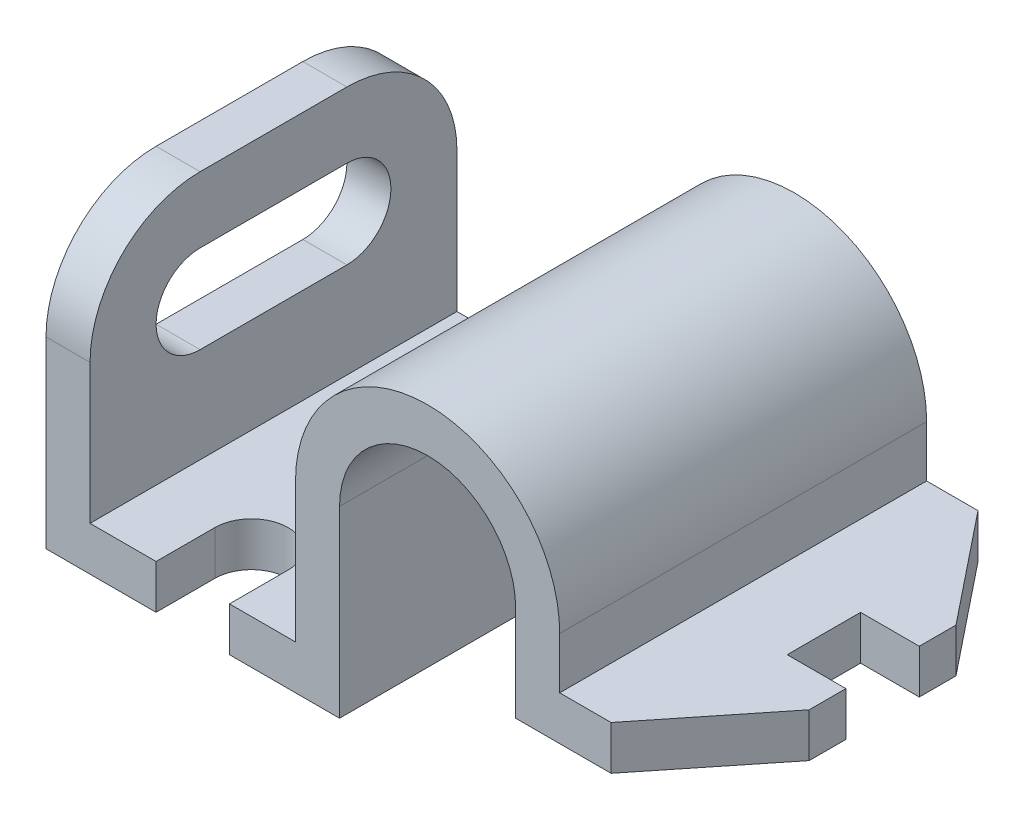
ISO-10303-21;
HEADER;
FILE_DESCRIPTION(('STEP AP214'),'2;1');
FILE_NAME('part.step','',(''),(''),'','','');
FILE_SCHEMA(('AUTOMOTIVE_DESIGN { 1 0 10303 214 1 1 1 1 }'));
ENDSEC;
DATA;
#1=APPLICATION_CONTEXT('core data for automotive mechanical design processes');
#2=APPLICATION_PROTOCOL_DEFINITION('international standard','automotive_design',2000,#1);
#3=PRODUCT_CONTEXT('',#1,'mechanical');
#4=PRODUCT('Part','Part','',(#3));
#5=PRODUCT_RELATED_PRODUCT_CATEGORY('part','',(#4));
#6=PRODUCT_DEFINITION_FORMATION('','',#4);
#7=PRODUCT_DEFINITION_CONTEXT('part definition',#1,'design');
#8=PRODUCT_DEFINITION('design','',#6,#7);
#9=PRODUCT_DEFINITION_SHAPE('','',#8);
#10=(LENGTH_UNIT() NAMED_UNIT(*) SI_UNIT(.MILLI.,.METRE.));
#11=(NAMED_UNIT(*) PLANE_ANGLE_UNIT() SI_UNIT($,.RADIAN.));
#12=(NAMED_UNIT(*) SI_UNIT($,.STERADIAN.) SOLID_ANGLE_UNIT());
#13=UNCERTAINTY_MEASURE_WITH_UNIT(LENGTH_MEASURE(1.E-05),#10,'distance_accuracy_value','');
#14=(GEOMETRIC_REPRESENTATION_CONTEXT(3) GLOBAL_UNCERTAINTY_ASSIGNED_CONTEXT((#13)) GLOBAL_UNIT_ASSIGNED_CONTEXT((#10,
#11,#12)) REPRESENTATION_CONTEXT('',''));
#15=CARTESIAN_POINT('',(0.,0.,0.));
#16=DIRECTION('',(0.,0.,1.));
#17=DIRECTION('',(1.,0.,0.));
#18=AXIS2_PLACEMENT_3D('',#15,#16,#17);
#19=CARTESIAN_POINT('',(64.,12.,25.));
#20=DIRECTION('',(0.,1.,0.));
#21=DIRECTION('',(0.,0.,1.));
#22=AXIS2_PLACEMENT_3D('',#19,#20,#21);
#23=PLANE('',#22);
#24=DIRECTION('',(0.624695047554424,0.,0.780868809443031));
#25=VECTOR('',#24,1.);
#26=CARTESIAN_POINT('',(89.,12.,-9.99999999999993));
#27=LINE('',#26,#25);
#28=CARTESIAN_POINT('',(89.,12.,-9.99999999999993));
#29=VERTEX_POINT('',#28);
#30=CARTESIAN_POINT('',(77.,12.,-25.));
#31=VERTEX_POINT('',#30);
#32=EDGE_CURVE('E63',#29,#31,#27,.F.);
#33=ORIENTED_EDGE('',*,*,#32,.F.);
#34=DIRECTION('',(0.,0.,-1.));
#35=VECTOR('',#34,1.);
#36=CARTESIAN_POINT('',(89.,12.,25.));
#37=LINE('',#36,#35);
#38=CARTESIAN_POINT('',(89.,12.,-5.));
#39=VERTEX_POINT('',#38);
#40=EDGE_CURVE('E356',#39,#29,#37,.T.);
#41=ORIENTED_EDGE('',*,*,#40,.F.);
#42=DIRECTION('',(-1.,0.,0.));
#43=VECTOR('',#42,1.);
#44=CARTESIAN_POINT('',(64.,12.,-5.));
#45=LINE('',#44,#43);
#46=CARTESIAN_POINT('',(81.,12.,-5.));
#47=VERTEX_POINT('',#46);
#48=EDGE_CURVE('E406',#39,#47,#45,.T.);
#49=ORIENTED_EDGE('',*,*,#48,.T.);
#50=DIRECTION('',(0.,0.,1.));
#51=VECTOR('',#50,1.);
#52=CARTESIAN_POINT('',(81.,12.,25.));
#53=LINE('',#52,#51);
#54=CARTESIAN_POINT('',(81.,12.,5.));
#55=VERTEX_POINT('',#54);
#56=EDGE_CURVE('E398',#47,#55,#53,.T.);
#57=ORIENTED_EDGE('',*,*,#56,.T.);
#58=DIRECTION('',(1.,0.,0.));
#59=VECTOR('',#58,1.);
#60=CARTESIAN_POINT('',(64.,12.,5.));
#61=LINE('',#60,#59);
#62=CARTESIAN_POINT('',(89.,12.,5.));
#63=VERTEX_POINT('',#62);
#64=EDGE_CURVE('E396',#55,#63,#61,.T.);
#65=ORIENTED_EDGE('',*,*,#64,.T.);
#66=CARTESIAN_POINT('',(89.,12.,9.99999999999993));
#67=VERTEX_POINT('',#66);
#68=EDGE_CURVE('E357',#67,#63,#37,.T.);
#69=ORIENTED_EDGE('',*,*,#68,.F.);
#70=DIRECTION('',(0.624695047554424,0.,-0.780868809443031));
#71=VECTOR('',#70,1.);
#72=CARTESIAN_POINT('',(89.,12.,9.99999999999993));
#73=LINE('',#72,#71);
#74=CARTESIAN_POINT('',(77.,12.,25.));
#75=VERTEX_POINT('',#74);
#76=EDGE_CURVE('E371',#67,#75,#73,.F.);
#77=ORIENTED_EDGE('',*,*,#76,.T.);
#78=DIRECTION('',(1.,0.,0.));
#79=VECTOR('',#78,1.);
#80=CARTESIAN_POINT('',(64.,12.,25.));
#81=LINE('',#80,#79);
#82=CARTESIAN_POINT('',(64.,12.,25.));
#83=VERTEX_POINT('',#82);
#84=EDGE_CURVE('E319',#83,#75,#81,.T.);
#85=ORIENTED_EDGE('',*,*,#84,.F.);
#86=DIRECTION('',(0.,0.,-1.));
#87=VECTOR('',#86,1.);
#88=CARTESIAN_POINT('',(64.,12.,25.));
#89=LINE('',#88,#87);
#90=CARTESIAN_POINT('',(64.,12.,-25.));
#91=VERTEX_POINT('',#90);
#92=EDGE_CURVE('E320',#83,#91,#89,.T.);
#93=ORIENTED_EDGE('',*,*,#92,.T.);
#94=DIRECTION('',(1.,0.,0.));
#95=VECTOR('',#94,1.);
#96=CARTESIAN_POINT('',(64.,12.,-25.));
#97=LINE('',#96,#95);
#98=EDGE_CURVE('E289',#91,#31,#97,.T.);
#99=ORIENTED_EDGE('',*,*,#98,.T.);
#100=EDGE_LOOP('',(#33,#41,#49,#57,#65,#69,#77,#85,#93,#99));
#101=FACE_BOUND('',#100,.T.);
#102=ADVANCED_FACE('F48',(#101),#23,.F.);
#103=CARTESIAN_POINT('',(89.,18.,25.));
#104=DIRECTION('',(1.,0.,0.));
#105=DIRECTION('',(0.,0.,-1.));
#106=AXIS2_PLACEMENT_3D('',#103,#104,#105);
#107=PLANE('',#106);
#108=ORIENTED_EDGE('',*,*,#40,.T.);
#109=DIRECTION('',(0.,-1.,0.));
#110=VECTOR('',#109,1.);
#111=CARTESIAN_POINT('',(89.,18.,-9.99999999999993));
#112=LINE('',#111,#110);
#113=CARTESIAN_POINT('',(89.,18.,-9.99999999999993));
#114=VERTEX_POINT('',#113);
#115=EDGE_CURVE('E598',#114,#29,#112,.T.);
#116=ORIENTED_EDGE('',*,*,#115,.F.);
#117=DIRECTION('',(0.,0.,-1.));
#118=VECTOR('',#117,1.);
#119=CARTESIAN_POINT('',(89.,18.,25.));
#120=LINE('',#119,#118);
#121=CARTESIAN_POINT('',(89.,18.,-5.));
#122=VERTEX_POINT('',#121);
#123=EDGE_CURVE('E283',#122,#114,#120,.T.);
#124=ORIENTED_EDGE('',*,*,#123,.F.);
#125=DIRECTION('',(0.,1.,0.));
#126=VECTOR('',#125,1.);
#127=CARTESIAN_POINT('',(89.,0.,-5.));
#128=LINE('',#127,#126);
#129=EDGE_CURVE('E583',#39,#122,#128,.T.);
#130=ORIENTED_EDGE('',*,*,#129,.F.);
#131=EDGE_LOOP('',(#108,#116,#124,#130));
#132=FACE_BOUND('',#131,.T.);
#133=ADVANCED_FACE('F597',(#132),#107,.T.);
#134=CARTESIAN_POINT('',(64.,18.,25.));
#135=DIRECTION('',(0.,1.,0.));
#136=DIRECTION('',(0.,0.,1.));
#137=AXIS2_PLACEMENT_3D('',#134,#135,#136);
#138=PLANE('',#137);
#139=ORIENTED_EDGE('',*,*,#123,.T.);
#140=DIRECTION('',(-0.624695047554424,0.,-0.780868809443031));
#141=VECTOR('',#140,1.);
#142=CARTESIAN_POINT('',(71.9268292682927,18.,-31.3414634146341));
#143=LINE('',#142,#141);
#144=CARTESIAN_POINT('',(77.,18.,-25.));
#145=VERTEX_POINT('',#144);
#146=EDGE_CURVE('E268',#145,#114,#143,.F.);
#147=ORIENTED_EDGE('',*,*,#146,.F.);
#148=DIRECTION('',(1.,0.,0.));
#149=VECTOR('',#148,1.);
#150=CARTESIAN_POINT('',(64.,18.,-25.));
#151=LINE('',#150,#149);
#152=CARTESIAN_POINT('',(70.,18.,-25.));
#153=VERTEX_POINT('',#152);
#154=EDGE_CURVE('E279',#153,#145,#151,.T.);
#155=ORIENTED_EDGE('',*,*,#154,.F.);
#156=DIRECTION('',(0.,0.,-1.));
#157=VECTOR('',#156,1.);
#158=CARTESIAN_POINT('',(70.,18.,25.));
#159=LINE('',#158,#157);
#160=CARTESIAN_POINT('',(70.,18.,25.));
#161=VERTEX_POINT('',#160);
#162=EDGE_CURVE('E352',#161,#153,#159,.T.);
#163=ORIENTED_EDGE('',*,*,#162,.F.);
#164=DIRECTION('',(1.,0.,0.));
#165=VECTOR('',#164,1.);
#166=CARTESIAN_POINT('',(64.,18.,25.));
#167=LINE('',#166,#165);
#168=CARTESIAN_POINT('',(77.,18.,25.));
#169=VERTEX_POINT('',#168);
#170=EDGE_CURVE('E379',#161,#169,#167,.T.);
#171=ORIENTED_EDGE('',*,*,#170,.T.);
#172=DIRECTION('',(-0.624695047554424,0.,0.780868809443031));
#173=VECTOR('',#172,1.);
#174=CARTESIAN_POINT('',(71.9268292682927,18.,31.3414634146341));
#175=LINE('',#174,#173);
#176=CARTESIAN_POINT('',(89.,18.,9.99999999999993));
#177=VERTEX_POINT('',#176);
#178=EDGE_CURVE('E13',#169,#177,#175,.F.);
#179=ORIENTED_EDGE('',*,*,#178,.T.);
#180=CARTESIAN_POINT('',(89.,18.,5.));
#181=VERTEX_POINT('',#180);
#182=EDGE_CURVE('E354',#177,#181,#120,.T.);
#183=ORIENTED_EDGE('',*,*,#182,.T.);
#184=DIRECTION('',(1.,0.,0.));
#185=VECTOR('',#184,1.);
#186=CARTESIAN_POINT('',(89.,18.,5.));
#187=LINE('',#186,#185);
#188=CARTESIAN_POINT('',(81.,18.,5.));
#189=VERTEX_POINT('',#188);
#190=EDGE_CURVE('E580',#189,#181,#187,.T.);
#191=ORIENTED_EDGE('',*,*,#190,.F.);
#192=DIRECTION('',(0.,0.,1.));
#193=VECTOR('',#192,1.);
#194=CARTESIAN_POINT('',(81.,18.,5.));
#195=LINE('',#194,#193);
#196=CARTESIAN_POINT('',(81.,18.,-5.));
#197=VERTEX_POINT('',#196);
#198=EDGE_CURVE('E577',#197,#189,#195,.T.);
#199=ORIENTED_EDGE('',*,*,#198,.F.);
#200=DIRECTION('',(-1.,0.,0.));
#201=VECTOR('',#200,1.);
#202=CARTESIAN_POINT('',(89.,18.,-5.));
#203=LINE('',#202,#201);
#204=EDGE_CURVE('E569',#122,#197,#203,.T.);
#205=ORIENTED_EDGE('',*,*,#204,.F.);
#206=EDGE_LOOP('',(#139,#147,#155,#163,#171,#179,#183,#191,#199,#205));
#207=FACE_BOUND('',#206,.T.);
#208=ADVANCED_FACE('F278',(#207),#138,.T.);
#209=CARTESIAN_POINT('',(52.,25.,-25.));
#210=DIRECTION('',(0.,0.,1.));
#211=DIRECTION('',(1.,0.,0.));
#212=AXIS2_PLACEMENT_3D('',#209,#210,#211);
#213=PLANE('',#212);
#214=DIRECTION('',(0.,1.,0.));
#215=VECTOR('',#214,1.);
#216=CARTESIAN_POINT('',(77.,25.,-25.));
#217=LINE('',#216,#215);
#218=EDGE_CURVE('E265',#31,#145,#217,.T.);
#219=ORIENTED_EDGE('',*,*,#218,.F.);
#220=ORIENTED_EDGE('',*,*,#98,.F.);
#221=DIRECTION('',(0.,-1.,0.));
#222=VECTOR('',#221,1.);
#223=CARTESIAN_POINT('',(64.,25.,-25.));
#224=LINE('',#223,#222);
#225=CARTESIAN_POINT('',(64.,25.,-25.));
#226=VERTEX_POINT('',#225);
#227=EDGE_CURVE('E317',#226,#91,#224,.T.);
#228=ORIENTED_EDGE('',*,*,#227,.F.);
#229=CARTESIAN_POINT('',(52.,25.,-25.));
#230=DIRECTION('',(0.,0.,-1.));
#231=DIRECTION('',(-1.,0.,0.));
#232=AXIS2_PLACEMENT_3D('',#229,#230,#231);
#233=CIRCLE('',#232,12.);
#234=CARTESIAN_POINT('',(40.,25.,-25.));
#235=VERTEX_POINT('',#234);
#236=EDGE_CURVE('E315',#235,#226,#233,.T.);
#237=ORIENTED_EDGE('',*,*,#236,.F.);
#238=DIRECTION('',(0.,1.,0.));
#239=VECTOR('',#238,1.);
#240=CARTESIAN_POINT('',(40.,0.,-25.));
#241=LINE('',#240,#239);
#242=CARTESIAN_POINT('',(40.,0.,-25.));
#243=VERTEX_POINT('',#242);
#244=EDGE_CURVE('E313',#243,#235,#241,.T.);
#245=ORIENTED_EDGE('',*,*,#244,.F.);
#246=DIRECTION('',(1.,0.,0.));
#247=VECTOR('',#246,1.);
#248=CARTESIAN_POINT('',(0.,0.,-25.));
#249=LINE('',#248,#247);
#250=CARTESIAN_POINT('',(25.,0.,-25.));
#251=VERTEX_POINT('',#250);
#252=EDGE_CURVE('E309',#251,#243,#249,.T.);
#253=ORIENTED_EDGE('',*,*,#252,.F.);
#254=DIRECTION('',(0.,1.,0.));
#255=VECTOR('',#254,1.);
#256=CARTESIAN_POINT('',(25.,0.,-25.));
#257=LINE('',#256,#255);
#258=CARTESIAN_POINT('',(25.,6.,-25.));
#259=VERTEX_POINT('',#258);
#260=EDGE_CURVE('E511',#251,#259,#257,.T.);
#261=ORIENTED_EDGE('',*,*,#260,.T.);
#262=DIRECTION('',(1.,0.,0.));
#263=VECTOR('',#262,1.);
#264=CARTESIAN_POINT('',(0.,6.,-25.));
#265=LINE('',#264,#263);
#266=CARTESIAN_POINT('',(34.,6.,-25.));
#267=VERTEX_POINT('',#266);
#268=EDGE_CURVE('E301',#259,#267,#265,.T.);
#269=ORIENTED_EDGE('',*,*,#268,.T.);
#270=DIRECTION('',(0.,1.,0.));
#271=VECTOR('',#270,1.);
#272=CARTESIAN_POINT('',(34.,0.,-25.));
#273=LINE('',#272,#271);
#274=CARTESIAN_POINT('',(34.,25.,-25.));
#275=VERTEX_POINT('',#274);
#276=EDGE_CURVE('E298',#267,#275,#273,.T.);
#277=ORIENTED_EDGE('',*,*,#276,.T.);
#278=CARTESIAN_POINT('',(52.,25.,-25.));
#279=DIRECTION('',(0.,0.,1.));
#280=DIRECTION('',(1.,0.,0.));
#281=AXIS2_PLACEMENT_3D('',#278,#279,#280);
#282=CIRCLE('',#281,18.);
#283=CARTESIAN_POINT('',(70.,25.,-25.));
#284=VERTEX_POINT('',#283);
#285=EDGE_CURVE('E291',#275,#284,#282,.F.);
#286=ORIENTED_EDGE('',*,*,#285,.T.);
#287=DIRECTION('',(0.,1.,0.));
#288=VECTOR('',#287,1.);
#289=CARTESIAN_POINT('',(70.,25.,-25.));
#290=LINE('',#289,#288);
#291=EDGE_CURVE('E288',#284,#153,#290,.F.);
#292=ORIENTED_EDGE('',*,*,#291,.T.);
#293=ORIENTED_EDGE('',*,*,#154,.T.);
#294=EDGE_LOOP('',(#219,#220,#228,#237,#245,#253,#261,#269,#277,#286,#292,#293));
#295=FACE_BOUND('',#294,.T.);
#296=ADVANCED_FACE('F285',(#295),#213,.F.);
#297=CARTESIAN_POINT('',(6.,40.,25.));
#298=DIRECTION('',(1.,0.,0.));
#299=DIRECTION('',(0.,1.,0.));
#300=AXIS2_PLACEMENT_3D('',#297,#298,#299);
#301=PLANE('',#300);
#302=CARTESIAN_POINT('',(6.00000000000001,25.,-10.));
#303=DIRECTION('',(1.,0.,0.));
#304=DIRECTION('',(0.,1.,0.));
#305=AXIS2_PLACEMENT_3D('',#302,#303,#304);
#306=CIRCLE('',#305,5.99999999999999);
#307=CARTESIAN_POINT('',(6.00000000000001,31.,-10.));
#308=VERTEX_POINT('',#307);
#309=CARTESIAN_POINT('',(6.00000000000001,19.,-10.));
#310=VERTEX_POINT('',#309);
#311=EDGE_CURVE('E427',#308,#310,#306,.F.);
#312=ORIENTED_EDGE('',*,*,#311,.T.);
#313=DIRECTION('',(0.,0.,1.));
#314=VECTOR('',#313,1.);
#315=CARTESIAN_POINT('',(6.00000000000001,19.,-10.));
#316=LINE('',#315,#314);
#317=CARTESIAN_POINT('',(6.,19.,10.));
#318=VERTEX_POINT('',#317);
#319=EDGE_CURVE('E433',#310,#318,#316,.T.);
#320=ORIENTED_EDGE('',*,*,#319,.T.);
#321=CARTESIAN_POINT('',(6.00000000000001,25.,10.));
#322=DIRECTION('',(1.,0.,0.));
#323=DIRECTION('',(0.,1.,0.));
#324=AXIS2_PLACEMENT_3D('',#321,#322,#323);
#325=CIRCLE('',#324,5.99999999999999);
#326=CARTESIAN_POINT('',(6.00000000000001,31.,10.));
#327=VERTEX_POINT('',#326);
#328=EDGE_CURVE('E455',#318,#327,#325,.F.);
#329=ORIENTED_EDGE('',*,*,#328,.T.);
#330=DIRECTION('',(0.,0.,-1.));
#331=VECTOR('',#330,1.);
#332=CARTESIAN_POINT('',(6.00000000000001,31.,-10.));
#333=LINE('',#332,#331);
#334=EDGE_CURVE('E451',#327,#308,#333,.T.);
#335=ORIENTED_EDGE('',*,*,#334,.T.);
#336=EDGE_LOOP('',(#312,#320,#329,#335));
#337=FACE_BOUND('',#336,.T.);
#338=DIRECTION('',(0.,-1.,0.));
#339=VECTOR('',#338,1.);
#340=CARTESIAN_POINT('',(6.,40.,-25.));
#341=LINE('',#340,#339);
#342=CARTESIAN_POINT('',(6.,25.,-25.));
#343=VERTEX_POINT('',#342);
#344=CARTESIAN_POINT('',(6.,6.,-25.));
#345=VERTEX_POINT('',#344);
#346=EDGE_CURVE('E305',#343,#345,#341,.T.);
#347=ORIENTED_EDGE('',*,*,#346,.F.);
#348=CARTESIAN_POINT('',(6.,25.,-10.));
#349=DIRECTION('',(-1.,0.,0.));
#350=DIRECTION('',(0.,1.,0.));
#351=AXIS2_PLACEMENT_3D('',#348,#349,#350);
#352=CIRCLE('',#351,15.);
#353=CARTESIAN_POINT('',(6.,40.,-10.));
#354=VERTEX_POINT('',#353);
#355=EDGE_CURVE('E605',#354,#343,#352,.T.);
#356=ORIENTED_EDGE('',*,*,#355,.F.);
#357=DIRECTION('',(0.,0.,-1.));
#358=VECTOR('',#357,1.);
#359=CARTESIAN_POINT('',(6.,40.,25.));
#360=LINE('',#359,#358);
#361=CARTESIAN_POINT('',(6.,40.,10.));
#362=VERTEX_POINT('',#361);
#363=EDGE_CURVE('E339',#362,#354,#360,.T.);
#364=ORIENTED_EDGE('',*,*,#363,.F.);
#365=CARTESIAN_POINT('',(6.,25.,10.));
#366=DIRECTION('',(1.,0.,0.));
#367=DIRECTION('',(0.,1.,0.));
#368=AXIS2_PLACEMENT_3D('',#365,#366,#367);
#369=CIRCLE('',#368,15.);
#370=CARTESIAN_POINT('',(6.,25.,25.));
#371=VERTEX_POINT('',#370);
#372=EDGE_CURVE('E362',#362,#371,#369,.T.);
#373=ORIENTED_EDGE('',*,*,#372,.T.);
#374=DIRECTION('',(0.,-1.,0.));
#375=VECTOR('',#374,1.);
#376=CARTESIAN_POINT('',(6.,40.,25.));
#377=LINE('',#376,#375);
#378=CARTESIAN_POINT('',(6.,6.,25.));
#379=VERTEX_POINT('',#378);
#380=EDGE_CURVE('E475',#371,#379,#377,.T.);
#381=ORIENTED_EDGE('',*,*,#380,.T.);
#382=DIRECTION('',(0.,0.,-1.));
#383=VECTOR('',#382,1.);
#384=CARTESIAN_POINT('',(6.,6.,25.));
#385=LINE('',#384,#383);
#386=EDGE_CURVE('E342',#379,#345,#385,.T.);
#387=ORIENTED_EDGE('',*,*,#386,.T.);
#388=EDGE_LOOP('',(#347,#356,#364,#373,#381,#387));
#389=FACE_BOUND('',#388,.T.);
#390=ADVANCED_FACE('F633',(#337,#389),#301,.T.);
#391=CARTESIAN_POINT('',(0.,40.,25.));
#392=DIRECTION('',(1.,0.,0.));
#393=DIRECTION('',(0.,1.,0.));
#394=AXIS2_PLACEMENT_3D('',#391,#392,#393);
#395=PLANE('',#394);
#396=DIRECTION('',(0.,0.,1.));
#397=VECTOR('',#396,1.);
#398=CARTESIAN_POINT('',(0.,19.,-10.));
#399=LINE('',#398,#397);
#400=CARTESIAN_POINT('',(0.,19.,-10.));
#401=VERTEX_POINT('',#400);
#402=CARTESIAN_POINT('',(0.,19.,10.));
#403=VERTEX_POINT('',#402);
#404=EDGE_CURVE('E443',#401,#403,#399,.T.);
#405=ORIENTED_EDGE('',*,*,#404,.F.);
#406=CARTESIAN_POINT('',(0.,25.,-10.));
#407=DIRECTION('',(-1.,0.,0.));
#408=DIRECTION('',(0.,-1.,0.));
#409=AXIS2_PLACEMENT_3D('',#406,#407,#408);
#410=CIRCLE('',#409,5.99999999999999);
#411=CARTESIAN_POINT('',(0.,31.,-10.));
#412=VERTEX_POINT('',#411);
#413=EDGE_CURVE('E446',#412,#401,#410,.T.);
#414=ORIENTED_EDGE('',*,*,#413,.F.);
#415=DIRECTION('',(0.,0.,-1.));
#416=VECTOR('',#415,1.);
#417=CARTESIAN_POINT('',(0.,31.,-10.));
#418=LINE('',#417,#416);
#419=CARTESIAN_POINT('',(0.,31.,10.));
#420=VERTEX_POINT('',#419);
#421=EDGE_CURVE('E293',#420,#412,#418,.T.);
#422=ORIENTED_EDGE('',*,*,#421,.F.);
#423=CARTESIAN_POINT('',(0.,25.,10.));
#424=DIRECTION('',(-1.,0.,0.));
#425=DIRECTION('',(0.,-1.,0.));
#426=AXIS2_PLACEMENT_3D('',#423,#424,#425);
#427=CIRCLE('',#426,5.99999999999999);
#428=EDGE_CURVE('E440',#403,#420,#427,.T.);
#429=ORIENTED_EDGE('',*,*,#428,.F.);
#430=EDGE_LOOP('',(#405,#414,#422,#429));
#431=FACE_BOUND('',#430,.T.);
#432=CARTESIAN_POINT('',(0.,25.,-10.));
#433=DIRECTION('',(-1.,0.,0.));
#434=DIRECTION('',(0.,1.,0.));
#435=AXIS2_PLACEMENT_3D('',#432,#433,#434);
#436=CIRCLE('',#435,15.);
#437=CARTESIAN_POINT('',(0.,25.,-25.));
#438=VERTEX_POINT('',#437);
#439=CARTESIAN_POINT('',(0.,40.,-10.));
#440=VERTEX_POINT('',#439);
#441=EDGE_CURVE('E599',#438,#440,#436,.F.);
#442=ORIENTED_EDGE('',*,*,#441,.F.);
#443=DIRECTION('',(0.,-1.,0.));
#444=VECTOR('',#443,1.);
#445=CARTESIAN_POINT('',(0.,40.,-25.));
#446=LINE('',#445,#444);
#447=CARTESIAN_POINT('',(0.,0.,-25.));
#448=VERTEX_POINT('',#447);
#449=EDGE_CURVE('E307',#438,#448,#446,.T.);
#450=ORIENTED_EDGE('',*,*,#449,.T.);
#451=DIRECTION('',(0.,0.,-1.));
#452=VECTOR('',#451,1.);
#453=CARTESIAN_POINT('',(0.,0.,25.));
#454=LINE('',#453,#452);
#455=CARTESIAN_POINT('',(0.,0.,25.));
#456=VERTEX_POINT('',#455);
#457=EDGE_CURVE('E333',#456,#448,#454,.T.);
#458=ORIENTED_EDGE('',*,*,#457,.F.);
#459=DIRECTION('',(0.,-1.,0.));
#460=VECTOR('',#459,1.);
#461=CARTESIAN_POINT('',(0.,40.,25.));
#462=LINE('',#461,#460);
#463=CARTESIAN_POINT('',(0.,25.,25.));
#464=VERTEX_POINT('',#463);
#465=EDGE_CURVE('E477',#464,#456,#462,.T.);
#466=ORIENTED_EDGE('',*,*,#465,.F.);
#467=CARTESIAN_POINT('',(0.,25.,10.));
#468=DIRECTION('',(1.,0.,0.));
#469=DIRECTION('',(0.,1.,0.));
#470=AXIS2_PLACEMENT_3D('',#467,#468,#469);
#471=CIRCLE('',#470,15.);
#472=CARTESIAN_POINT('',(0.,40.,10.));
#473=VERTEX_POINT('',#472);
#474=EDGE_CURVE('E366',#464,#473,#471,.F.);
#475=ORIENTED_EDGE('',*,*,#474,.T.);
#476=DIRECTION('',(0.,0.,-1.));
#477=VECTOR('',#476,1.);
#478=CARTESIAN_POINT('',(0.,40.,25.));
#479=LINE('',#478,#477);
#480=EDGE_CURVE('E336',#473,#440,#479,.T.);
#481=ORIENTED_EDGE('',*,*,#480,.T.);
#482=EDGE_LOOP('',(#442,#450,#458,#466,#475,#481));
#483=FACE_BOUND('',#482,.T.);
#484=ADVANCED_FACE('F555',(#431,#483),#395,.F.);
#485=ORIENTED_EDGE('',*,*,#449,.F.);
#486=DIRECTION('',(1.,0.,0.));
#487=VECTOR('',#486,1.);
#488=CARTESIAN_POINT('',(52.,25.,-25.));
#489=LINE('',#488,#487);
#490=EDGE_CURVE('E71',#343,#438,#489,.F.);
#491=ORIENTED_EDGE('',*,*,#490,.F.);
#492=ORIENTED_EDGE('',*,*,#346,.T.);
#493=CARTESIAN_POINT('',(15.,6.,-25.));
#494=VERTEX_POINT('',#493);
#495=EDGE_CURVE('E302',#345,#494,#265,.T.);
#496=ORIENTED_EDGE('',*,*,#495,.T.);
#497=DIRECTION('',(0.,1.,0.));
#498=VECTOR('',#497,1.);
#499=CARTESIAN_POINT('',(15.,0.,-25.));
#500=LINE('',#499,#498);
#501=CARTESIAN_POINT('',(15.,0.,-25.));
#502=VERTEX_POINT('',#501);
#503=EDGE_CURVE('E562',#502,#494,#500,.T.);
#504=ORIENTED_EDGE('',*,*,#503,.F.);
#505=EDGE_CURVE('E310',#448,#502,#249,.T.);
#506=ORIENTED_EDGE('',*,*,#505,.F.);
#507=EDGE_LOOP('',(#485,#491,#492,#496,#504,#506));
#508=FACE_BOUND('',#507,.T.);
#509=ADVANCED_FACE('F561',(#508),#213,.F.);
#510=ORIENTED_EDGE('',*,*,#182,.F.);
#511=DIRECTION('',(0.,-1.,0.));
#512=VECTOR('',#511,1.);
#513=CARTESIAN_POINT('',(89.,18.,9.99999999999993));
#514=LINE('',#513,#512);
#515=EDGE_CURVE('E368',#177,#67,#514,.T.);
#516=ORIENTED_EDGE('',*,*,#515,.T.);
#517=ORIENTED_EDGE('',*,*,#68,.T.);
#518=DIRECTION('',(0.,1.,0.));
#519=VECTOR('',#518,1.);
#520=CARTESIAN_POINT('',(89.,0.,5.));
#521=LINE('',#520,#519);
#522=EDGE_CURVE('E584',#63,#181,#521,.T.);
#523=ORIENTED_EDGE('',*,*,#522,.T.);
#524=EDGE_LOOP('',(#510,#516,#517,#523));
#525=FACE_BOUND('',#524,.T.);
#526=ADVANCED_FACE('F390',(#525),#107,.T.);
#527=CARTESIAN_POINT('',(52.,25.,25.));
#528=DIRECTION('',(0.,0.,1.));
#529=DIRECTION('',(1.,0.,0.));
#530=AXIS2_PLACEMENT_3D('',#527,#528,#529);
#531=PLANE('',#530);
#532=ORIENTED_EDGE('',*,*,#380,.F.);
#533=DIRECTION('',(1.,0.,0.));
#534=VECTOR('',#533,1.);
#535=CARTESIAN_POINT('',(52.,25.,25.));
#536=LINE('',#535,#534);
#537=EDGE_CURVE('E364',#371,#464,#536,.F.);
#538=ORIENTED_EDGE('',*,*,#537,.T.);
#539=ORIENTED_EDGE('',*,*,#465,.T.);
#540=DIRECTION('',(1.,0.,0.));
#541=VECTOR('',#540,1.);
#542=CARTESIAN_POINT('',(0.,0.,25.));
#543=LINE('',#542,#541);
#544=CARTESIAN_POINT('',(15.,0.,25.));
#545=VERTEX_POINT('',#544);
#546=EDGE_CURVE('E480',#456,#545,#543,.T.);
#547=ORIENTED_EDGE('',*,*,#546,.T.);
#548=DIRECTION('',(0.,1.,0.));
#549=VECTOR('',#548,1.);
#550=CARTESIAN_POINT('',(15.,0.,25.));
#551=LINE('',#550,#549);
#552=CARTESIAN_POINT('',(15.,6.,25.));
#553=VERTEX_POINT('',#552);
#554=EDGE_CURVE('E424',#545,#553,#551,.T.);
#555=ORIENTED_EDGE('',*,*,#554,.T.);
#556=DIRECTION('',(1.,0.,0.));
#557=VECTOR('',#556,1.);
#558=CARTESIAN_POINT('',(0.,6.,25.));
#559=LINE('',#558,#557);
#560=EDGE_CURVE('E472',#379,#553,#559,.T.);
#561=ORIENTED_EDGE('',*,*,#560,.F.);
#562=EDGE_LOOP('',(#532,#538,#539,#547,#555,#561));
#563=FACE_BOUND('',#562,.T.);
#564=ADVANCED_FACE('F548',(#563),#531,.T.);
#565=CARTESIAN_POINT('',(70.,25.,25.));
#566=DIRECTION('',(1.,0.,0.));
#567=DIRECTION('',(0.,0.,-1.));
#568=AXIS2_PLACEMENT_3D('',#565,#566,#567);
#569=PLANE('',#568);
#570=ORIENTED_EDGE('',*,*,#291,.F.);
#571=DIRECTION('',(0.,0.,-1.));
#572=VECTOR('',#571,1.);
#573=CARTESIAN_POINT('',(70.,25.,25.));
#574=LINE('',#573,#572);
#575=CARTESIAN_POINT('',(70.,25.,25.));
#576=VERTEX_POINT('',#575);
#577=EDGE_CURVE('E350',#576,#284,#574,.T.);
#578=ORIENTED_EDGE('',*,*,#577,.F.);
#579=DIRECTION('',(0.,1.,0.));
#580=VECTOR('',#579,1.);
#581=CARTESIAN_POINT('',(70.,25.,25.));
#582=LINE('',#581,#580);
#583=EDGE_CURVE('E385',#576,#161,#582,.F.);
#584=ORIENTED_EDGE('',*,*,#583,.T.);
#585=ORIENTED_EDGE('',*,*,#162,.T.);
#586=EDGE_LOOP('',(#570,#578,#584,#585));
#587=FACE_BOUND('',#586,.T.);
#588=ADVANCED_FACE('F534',(#587),#569,.T.);
#589=CARTESIAN_POINT('',(52.,25.,25.));
#590=DIRECTION('',(0.,0.,-1.));
#591=DIRECTION('',(-1.,0.,0.));
#592=AXIS2_PLACEMENT_3D('',#589,#590,#591);
#593=CYLINDRICAL_SURFACE('',#592,18.);
#594=ORIENTED_EDGE('',*,*,#285,.F.);
#595=DIRECTION('',(0.,0.,-1.));
#596=VECTOR('',#595,1.);
#597=CARTESIAN_POINT('',(34.,25.,25.));
#598=LINE('',#597,#596);
#599=CARTESIAN_POINT('',(34.,25.,25.));
#600=VERTEX_POINT('',#599);
#601=EDGE_CURVE('E348',#600,#275,#598,.T.);
#602=ORIENTED_EDGE('',*,*,#601,.F.);
#603=CARTESIAN_POINT('',(52.,25.,25.));
#604=DIRECTION('',(0.,0.,1.));
#605=DIRECTION('',(1.,0.,0.));
#606=AXIS2_PLACEMENT_3D('',#603,#604,#605);
#607=CIRCLE('',#606,18.);
#608=EDGE_CURVE('E465',#600,#576,#607,.F.);
#609=ORIENTED_EDGE('',*,*,#608,.T.);
#610=ORIENTED_EDGE('',*,*,#577,.T.);
#611=EDGE_LOOP('',(#594,#602,#609,#610));
#612=FACE_BOUND('',#611,.T.);
#613=ADVANCED_FACE('F531',(#612),#593,.T.);
#614=CARTESIAN_POINT('',(34.,0.,25.));
#615=DIRECTION('',(-1.,0.,0.));
#616=DIRECTION('',(0.,-1.,0.));
#617=AXIS2_PLACEMENT_3D('',#614,#615,#616);
#618=PLANE('',#617);
#619=ORIENTED_EDGE('',*,*,#276,.F.);
#620=DIRECTION('',(0.,0.,-1.));
#621=VECTOR('',#620,1.);
#622=CARTESIAN_POINT('',(34.,6.,25.));
#623=LINE('',#622,#621);
#624=CARTESIAN_POINT('',(34.,6.,25.));
#625=VERTEX_POINT('',#624);
#626=EDGE_CURVE('E345',#625,#267,#623,.T.);
#627=ORIENTED_EDGE('',*,*,#626,.F.);
#628=DIRECTION('',(0.,1.,0.));
#629=VECTOR('',#628,1.);
#630=CARTESIAN_POINT('',(34.,0.,25.));
#631=LINE('',#630,#629);
#632=EDGE_CURVE('E468',#625,#600,#631,.T.);
#633=ORIENTED_EDGE('',*,*,#632,.T.);
#634=ORIENTED_EDGE('',*,*,#601,.T.);
#635=EDGE_LOOP('',(#619,#627,#633,#634));
#636=FACE_BOUND('',#635,.T.);
#637=ADVANCED_FACE('F528',(#636),#618,.T.);
#638=CARTESIAN_POINT('',(0.,6.,25.));
#639=DIRECTION('',(0.,1.,0.));
#640=DIRECTION('',(0.,0.,1.));
#641=AXIS2_PLACEMENT_3D('',#638,#639,#640);
#642=PLANE('',#641);
#643=DIRECTION('',(0.,0.,-1.));
#644=VECTOR('',#643,1.);
#645=CARTESIAN_POINT('',(15.,6.,-25.));
#646=LINE('',#645,#644);
#647=CARTESIAN_POINT('',(15.,6.,-17.));
#648=VERTEX_POINT('',#647);
#649=EDGE_CURVE('E567',#648,#494,#646,.T.);
#650=ORIENTED_EDGE('',*,*,#649,.T.);
#651=ORIENTED_EDGE('',*,*,#495,.F.);
#652=ORIENTED_EDGE('',*,*,#386,.F.);
#653=ORIENTED_EDGE('',*,*,#560,.T.);
#654=DIRECTION('',(0.,0.,1.));
#655=VECTOR('',#654,1.);
#656=CARTESIAN_POINT('',(15.,6.,25.));
#657=LINE('',#656,#655);
#658=CARTESIAN_POINT('',(15.,6.,17.));
#659=VERTEX_POINT('',#658);
#660=EDGE_CURVE('E414',#659,#553,#657,.T.);
#661=ORIENTED_EDGE('',*,*,#660,.F.);
#662=CARTESIAN_POINT('',(20.,6.,17.));
#663=DIRECTION('',(0.,1.,0.));
#664=DIRECTION('',(0.,0.,-1.));
#665=AXIS2_PLACEMENT_3D('',#662,#663,#664);
#666=CIRCLE('',#665,5.00000000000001);
#667=CARTESIAN_POINT('',(25.,6.,17.));
#668=VERTEX_POINT('',#667);
#669=EDGE_CURVE('E404',#668,#659,#666,.T.);
#670=ORIENTED_EDGE('',*,*,#669,.F.);
#671=DIRECTION('',(0.,0.,-1.));
#672=VECTOR('',#671,1.);
#673=CARTESIAN_POINT('',(25.,6.,17.));
#674=LINE('',#673,#672);
#675=CARTESIAN_POINT('',(25.,6.,25.));
#676=VERTEX_POINT('',#675);
#677=EDGE_CURVE('E401',#676,#668,#674,.T.);
#678=ORIENTED_EDGE('',*,*,#677,.F.);
#679=EDGE_CURVE('E471',#676,#625,#559,.T.);
#680=ORIENTED_EDGE('',*,*,#679,.T.);
#681=ORIENTED_EDGE('',*,*,#626,.T.);
#682=ORIENTED_EDGE('',*,*,#268,.F.);
#683=DIRECTION('',(0.,0.,1.));
#684=VECTOR('',#683,1.);
#685=CARTESIAN_POINT('',(25.,6.,-17.));
#686=LINE('',#685,#684);
#687=CARTESIAN_POINT('',(25.,6.,-17.));
#688=VERTEX_POINT('',#687);
#689=EDGE_CURVE('E521',#259,#688,#686,.T.);
#690=ORIENTED_EDGE('',*,*,#689,.T.);
#691=CARTESIAN_POINT('',(20.,6.,-17.));
#692=DIRECTION('',(0.,-1.,0.));
#693=DIRECTION('',(0.,0.,1.));
#694=AXIS2_PLACEMENT_3D('',#691,#692,#693);
#695=CIRCLE('',#694,5.00000000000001);
#696=EDGE_CURVE('E514',#688,#648,#695,.T.);
#697=ORIENTED_EDGE('',*,*,#696,.T.);
#698=EDGE_LOOP('',(#650,#651,#652,#653,#661,#670,#678,#680,#681,#682,#690,#697));
#699=FACE_BOUND('',#698,.T.);
#700=ADVANCED_FACE('F519',(#699),#642,.T.);
#701=CARTESIAN_POINT('',(0.,40.,25.));
#702=DIRECTION('',(0.,1.,0.));
#703=DIRECTION('',(0.,0.,1.));
#704=AXIS2_PLACEMENT_3D('',#701,#702,#703);
#705=PLANE('',#704);
#706=DIRECTION('',(1.,0.,0.));
#707=VECTOR('',#706,1.);
#708=CARTESIAN_POINT('',(0.,40.,-10.));
#709=LINE('',#708,#707);
#710=EDGE_CURVE('E607',#440,#354,#709,.T.);
#711=ORIENTED_EDGE('',*,*,#710,.F.);
#712=ORIENTED_EDGE('',*,*,#480,.F.);
#713=DIRECTION('',(1.,0.,0.));
#714=VECTOR('',#713,1.);
#715=CARTESIAN_POINT('',(0.,40.,10.));
#716=LINE('',#715,#714);
#717=EDGE_CURVE('E359',#473,#362,#716,.T.);
#718=ORIENTED_EDGE('',*,*,#717,.T.);
#719=ORIENTED_EDGE('',*,*,#363,.T.);
#720=EDGE_LOOP('',(#711,#712,#718,#719));
#721=FACE_BOUND('',#720,.T.);
#722=ADVANCED_FACE('F629',(#721),#705,.T.);
#723=CARTESIAN_POINT('',(0.,0.,25.));
#724=DIRECTION('',(0.,1.,0.));
#725=DIRECTION('',(0.,0.,1.));
#726=AXIS2_PLACEMENT_3D('',#723,#724,#725);
#727=PLANE('',#726);
#728=ORIENTED_EDGE('',*,*,#505,.T.);
#729=DIRECTION('',(0.,0.,-1.));
#730=VECTOR('',#729,1.);
#731=CARTESIAN_POINT('',(15.,0.,-25.));
#732=LINE('',#731,#730);
#733=CARTESIAN_POINT('',(15.,0.,-17.));
#734=VERTEX_POINT('',#733);
#735=EDGE_CURVE('E566',#734,#502,#732,.T.);
#736=ORIENTED_EDGE('',*,*,#735,.F.);
#737=CARTESIAN_POINT('',(20.,0.,-17.));
#738=DIRECTION('',(0.,-1.,0.));
#739=DIRECTION('',(0.,0.,1.));
#740=AXIS2_PLACEMENT_3D('',#737,#738,#739);
#741=CIRCLE('',#740,5.00000000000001);
#742=CARTESIAN_POINT('',(25.,0.,-17.));
#743=VERTEX_POINT('',#742);
#744=EDGE_CURVE('E571',#743,#734,#741,.T.);
#745=ORIENTED_EDGE('',*,*,#744,.F.);
#746=DIRECTION('',(0.,0.,1.));
#747=VECTOR('',#746,1.);
#748=CARTESIAN_POINT('',(25.,0.,-17.));
#749=LINE('',#748,#747);
#750=EDGE_CURVE('E509',#251,#743,#749,.T.);
#751=ORIENTED_EDGE('',*,*,#750,.F.);
#752=ORIENTED_EDGE('',*,*,#252,.T.);
#753=DIRECTION('',(0.,0.,-1.));
#754=VECTOR('',#753,1.);
#755=CARTESIAN_POINT('',(40.,0.,25.));
#756=LINE('',#755,#754);
#757=CARTESIAN_POINT('',(40.,0.,25.));
#758=VERTEX_POINT('',#757);
#759=EDGE_CURVE('E330',#758,#243,#756,.T.);
#760=ORIENTED_EDGE('',*,*,#759,.F.);
#761=CARTESIAN_POINT('',(25.,0.,25.));
#762=VERTEX_POINT('',#761);
#763=EDGE_CURVE('E479',#762,#758,#543,.T.);
#764=ORIENTED_EDGE('',*,*,#763,.F.);
#765=DIRECTION('',(0.,0.,-1.));
#766=VECTOR('',#765,1.);
#767=CARTESIAN_POINT('',(25.,0.,17.));
#768=LINE('',#767,#766);
#769=CARTESIAN_POINT('',(25.,0.,17.));
#770=VERTEX_POINT('',#769);
#771=EDGE_CURVE('E410',#762,#770,#768,.T.);
#772=ORIENTED_EDGE('',*,*,#771,.T.);
#773=CARTESIAN_POINT('',(20.,0.,17.));
#774=DIRECTION('',(0.,1.,0.));
#775=DIRECTION('',(0.,0.,-1.));
#776=AXIS2_PLACEMENT_3D('',#773,#774,#775);
#777=CIRCLE('',#776,5.00000000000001);
#778=CARTESIAN_POINT('',(15.,0.,17.));
#779=VERTEX_POINT('',#778);
#780=EDGE_CURVE('E413',#770,#779,#777,.T.);
#781=ORIENTED_EDGE('',*,*,#780,.T.);
#782=DIRECTION('',(0.,0.,1.));
#783=VECTOR('',#782,1.);
#784=CARTESIAN_POINT('',(15.,0.,25.));
#785=LINE('',#784,#783);
#786=EDGE_CURVE('E417',#779,#545,#785,.T.);
#787=ORIENTED_EDGE('',*,*,#786,.T.);
#788=ORIENTED_EDGE('',*,*,#546,.F.);
#789=ORIENTED_EDGE('',*,*,#457,.T.);
#790=EDGE_LOOP('',(#728,#736,#745,#751,#752,#760,#764,#772,#781,#787,#788,#789));
#791=FACE_BOUND('',#790,.T.);
#792=ADVANCED_FACE('F505',(#791),#727,.F.);
#793=CARTESIAN_POINT('',(40.,0.,25.));
#794=DIRECTION('',(-1.,0.,0.));
#795=DIRECTION('',(0.,-1.,0.));
#796=AXIS2_PLACEMENT_3D('',#793,#794,#795);
#797=PLANE('',#796);
#798=ORIENTED_EDGE('',*,*,#244,.T.);
#799=DIRECTION('',(0.,0.,-1.));
#800=VECTOR('',#799,1.);
#801=CARTESIAN_POINT('',(40.,25.,25.));
#802=LINE('',#801,#800);
#803=CARTESIAN_POINT('',(40.,25.,25.));
#804=VERTEX_POINT('',#803);
#805=EDGE_CURVE('E327',#804,#235,#802,.T.);
#806=ORIENTED_EDGE('',*,*,#805,.F.);
#807=DIRECTION('',(0.,1.,0.));
#808=VECTOR('',#807,1.);
#809=CARTESIAN_POINT('',(40.,0.,25.));
#810=LINE('',#809,#808);
#811=EDGE_CURVE('E483',#758,#804,#810,.T.);
#812=ORIENTED_EDGE('',*,*,#811,.F.);
#813=ORIENTED_EDGE('',*,*,#759,.T.);
#814=EDGE_LOOP('',(#798,#806,#812,#813));
#815=FACE_BOUND('',#814,.T.);
#816=ADVANCED_FACE('F501',(#815),#797,.F.);
#817=CARTESIAN_POINT('',(52.,25.,25.));
#818=DIRECTION('',(0.,0.,-1.));
#819=DIRECTION('',(-1.,0.,0.));
#820=AXIS2_PLACEMENT_3D('',#817,#818,#819);
#821=CYLINDRICAL_SURFACE('',#820,12.);
#822=ORIENTED_EDGE('',*,*,#236,.T.);
#823=DIRECTION('',(0.,0.,-1.));
#824=VECTOR('',#823,1.);
#825=CARTESIAN_POINT('',(64.,25.,25.));
#826=LINE('',#825,#824);
#827=CARTESIAN_POINT('',(64.,25.,25.));
#828=VERTEX_POINT('',#827);
#829=EDGE_CURVE('E323',#828,#226,#826,.T.);
#830=ORIENTED_EDGE('',*,*,#829,.F.);
#831=CARTESIAN_POINT('',(52.,25.,25.));
#832=DIRECTION('',(0.,0.,-1.));
#833=DIRECTION('',(-1.,0.,0.));
#834=AXIS2_PLACEMENT_3D('',#831,#832,#833);
#835=CIRCLE('',#834,12.);
#836=EDGE_CURVE('E485',#804,#828,#835,.T.);
#837=ORIENTED_EDGE('',*,*,#836,.F.);
#838=ORIENTED_EDGE('',*,*,#805,.T.);
#839=EDGE_LOOP('',(#822,#830,#837,#838));
#840=FACE_BOUND('',#839,.T.);
#841=ADVANCED_FACE('F497',(#840),#821,.F.);
#842=CARTESIAN_POINT('',(64.,25.,25.));
#843=DIRECTION('',(1.,0.,0.));
#844=DIRECTION('',(0.,0.,-1.));
#845=AXIS2_PLACEMENT_3D('',#842,#843,#844);
#846=PLANE('',#845);
#847=ORIENTED_EDGE('',*,*,#227,.T.);
#848=ORIENTED_EDGE('',*,*,#92,.F.);
#849=DIRECTION('',(0.,-1.,0.));
#850=VECTOR('',#849,1.);
#851=CARTESIAN_POINT('',(64.,25.,25.));
#852=LINE('',#851,#850);
#853=EDGE_CURVE('E324',#828,#83,#852,.T.);
#854=ORIENTED_EDGE('',*,*,#853,.F.);
#855=ORIENTED_EDGE('',*,*,#829,.T.);
#856=EDGE_LOOP('',(#847,#848,#854,#855));
#857=FACE_BOUND('',#856,.T.);
#858=ADVANCED_FACE('F491',(#857),#846,.F.);
#859=ORIENTED_EDGE('',*,*,#84,.T.);
#860=DIRECTION('',(0.,1.,0.));
#861=VECTOR('',#860,1.);
#862=CARTESIAN_POINT('',(77.,25.,25.));
#863=LINE('',#862,#861);
#864=EDGE_CURVE('E56',#75,#169,#863,.T.);
#865=ORIENTED_EDGE('',*,*,#864,.T.);
#866=ORIENTED_EDGE('',*,*,#170,.F.);
#867=ORIENTED_EDGE('',*,*,#583,.F.);
#868=ORIENTED_EDGE('',*,*,#608,.F.);
#869=ORIENTED_EDGE('',*,*,#632,.F.);
#870=ORIENTED_EDGE('',*,*,#679,.F.);
#871=DIRECTION('',(0.,1.,0.));
#872=VECTOR('',#871,1.);
#873=CARTESIAN_POINT('',(25.,0.,25.));
#874=LINE('',#873,#872);
#875=EDGE_CURVE('E419',#762,#676,#874,.T.);
#876=ORIENTED_EDGE('',*,*,#875,.F.);
#877=ORIENTED_EDGE('',*,*,#763,.T.);
#878=ORIENTED_EDGE('',*,*,#811,.T.);
#879=ORIENTED_EDGE('',*,*,#836,.T.);
#880=ORIENTED_EDGE('',*,*,#853,.T.);
#881=EDGE_LOOP('',(#859,#865,#866,#867,#868,#869,#870,#876,#877,#878,#879,#880));
#882=FACE_BOUND('',#881,.T.);
#883=ADVANCED_FACE('F377',(#882),#531,.T.);
#884=CARTESIAN_POINT('',(89.001,25.,-10.));
#885=DIRECTION('',(-1.,0.,0.));
#886=DIRECTION('',(0.,-1.,0.));
#887=AXIS2_PLACEMENT_3D('',#884,#885,#886);
#888=CYLINDRICAL_SURFACE('',#887,5.99999999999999);
#889=DIRECTION('',(-1.,0.,0.));
#890=VECTOR('',#889,1.);
#891=CARTESIAN_POINT('',(89.001,31.,-10.));
#892=LINE('',#891,#890);
#893=EDGE_CURVE('E454',#308,#412,#892,.T.);
#894=ORIENTED_EDGE('',*,*,#893,.T.);
#895=ORIENTED_EDGE('',*,*,#413,.T.);
#896=DIRECTION('',(-1.,0.,0.));
#897=VECTOR('',#896,1.);
#898=CARTESIAN_POINT('',(89.001,19.,-10.));
#899=LINE('',#898,#897);
#900=EDGE_CURVE('E450',#310,#401,#899,.T.);
#901=ORIENTED_EDGE('',*,*,#900,.F.);
#902=ORIENTED_EDGE('',*,*,#311,.F.);
#903=EDGE_LOOP('',(#894,#895,#901,#902));
#904=FACE_BOUND('',#903,.T.);
#905=ADVANCED_FACE('F686',(#904),#888,.F.);
#906=CARTESIAN_POINT('',(89.001,31.,-10.));
#907=DIRECTION('',(0.,1.,0.));
#908=DIRECTION('',(0.,0.,1.));
#909=AXIS2_PLACEMENT_3D('',#906,#907,#908);
#910=PLANE('',#909);
#911=DIRECTION('',(-1.,0.,0.));
#912=VECTOR('',#911,1.);
#913=CARTESIAN_POINT('',(89.001,31.,10.));
#914=LINE('',#913,#912);
#915=EDGE_CURVE('E437',#327,#420,#914,.T.);
#916=ORIENTED_EDGE('',*,*,#915,.T.);
#917=ORIENTED_EDGE('',*,*,#421,.T.);
#918=ORIENTED_EDGE('',*,*,#893,.F.);
#919=ORIENTED_EDGE('',*,*,#334,.F.);
#920=EDGE_LOOP('',(#916,#917,#918,#919));
#921=FACE_BOUND('',#920,.T.);
#922=ADVANCED_FACE('F682',(#921),#910,.F.);
#923=CARTESIAN_POINT('',(89.001,25.,10.));
#924=DIRECTION('',(-1.,0.,0.));
#925=DIRECTION('',(0.,-1.,0.));
#926=AXIS2_PLACEMENT_3D('',#923,#924,#925);
#927=CYLINDRICAL_SURFACE('',#926,5.99999999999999);
#928=DIRECTION('',(-1.,0.,0.));
#929=VECTOR('',#928,1.);
#930=CARTESIAN_POINT('',(89.001,19.,10.));
#931=LINE('',#930,#929);
#932=EDGE_CURVE('E436',#318,#403,#931,.T.);
#933=ORIENTED_EDGE('',*,*,#932,.T.);
#934=ORIENTED_EDGE('',*,*,#428,.T.);
#935=ORIENTED_EDGE('',*,*,#915,.F.);
#936=ORIENTED_EDGE('',*,*,#328,.F.);
#937=EDGE_LOOP('',(#933,#934,#935,#936));
#938=FACE_BOUND('',#937,.T.);
#939=ADVANCED_FACE('F678',(#938),#927,.F.);
#940=CARTESIAN_POINT('',(89.001,19.,-10.));
#941=DIRECTION('',(0.,-1.,0.));
#942=DIRECTION('',(0.,0.,-1.));
#943=AXIS2_PLACEMENT_3D('',#940,#941,#942);
#944=PLANE('',#943);
#945=ORIENTED_EDGE('',*,*,#900,.T.);
#946=ORIENTED_EDGE('',*,*,#404,.T.);
#947=ORIENTED_EDGE('',*,*,#932,.F.);
#948=ORIENTED_EDGE('',*,*,#319,.F.);
#949=EDGE_LOOP('',(#945,#946,#947,#948));
#950=FACE_BOUND('',#949,.T.);
#951=ADVANCED_FACE('F671',(#950),#944,.F.);
#952=CARTESIAN_POINT('',(15.,0.,25.));
#953=DIRECTION('',(-1.,0.,0.));
#954=DIRECTION('',(0.,0.,1.));
#955=AXIS2_PLACEMENT_3D('',#952,#953,#954);
#956=PLANE('',#955);
#957=ORIENTED_EDGE('',*,*,#660,.T.);
#958=ORIENTED_EDGE('',*,*,#554,.F.);
#959=ORIENTED_EDGE('',*,*,#786,.F.);
#960=DIRECTION('',(0.,1.,0.));
#961=VECTOR('',#960,1.);
#962=CARTESIAN_POINT('',(15.,0.,17.));
#963=LINE('',#962,#961);
#964=EDGE_CURVE('E428',#779,#659,#963,.T.);
#965=ORIENTED_EDGE('',*,*,#964,.T.);
#966=EDGE_LOOP('',(#957,#958,#959,#965));
#967=FACE_BOUND('',#966,.T.);
#968=ADVANCED_FACE('F668',(#967),#956,.F.);
#969=CARTESIAN_POINT('',(20.,0.,17.));
#970=DIRECTION('',(0.,1.,0.));
#971=DIRECTION('',(0.,0.,1.));
#972=AXIS2_PLACEMENT_3D('',#969,#970,#971);
#973=CYLINDRICAL_SURFACE('',#972,5.00000000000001);
#974=ORIENTED_EDGE('',*,*,#669,.T.);
#975=ORIENTED_EDGE('',*,*,#964,.F.);
#976=ORIENTED_EDGE('',*,*,#780,.F.);
#977=DIRECTION('',(0.,1.,0.));
#978=VECTOR('',#977,1.);
#979=CARTESIAN_POINT('',(25.,0.,17.));
#980=LINE('',#979,#978);
#981=EDGE_CURVE('E430',#770,#668,#980,.T.);
#982=ORIENTED_EDGE('',*,*,#981,.T.);
#983=EDGE_LOOP('',(#974,#975,#976,#982));
#984=FACE_BOUND('',#983,.T.);
#985=ADVANCED_FACE('F541',(#984),#973,.F.);
#986=CARTESIAN_POINT('',(25.,0.,17.));
#987=DIRECTION('',(1.,0.,0.));
#988=DIRECTION('',(0.,0.,-1.));
#989=AXIS2_PLACEMENT_3D('',#986,#987,#988);
#990=PLANE('',#989);
#991=ORIENTED_EDGE('',*,*,#677,.T.);
#992=ORIENTED_EDGE('',*,*,#981,.F.);
#993=ORIENTED_EDGE('',*,*,#771,.F.);
#994=ORIENTED_EDGE('',*,*,#875,.T.);
#995=EDGE_LOOP('',(#991,#992,#993,#994));
#996=FACE_BOUND('',#995,.T.);
#997=ADVANCED_FACE('F537',(#996),#990,.F.);
#998=CARTESIAN_POINT('',(89.,0.,5.));
#999=DIRECTION('',(0.,0.,1.));
#1000=DIRECTION('',(1.,0.,0.));
#1001=AXIS2_PLACEMENT_3D('',#998,#999,#1000);
#1002=PLANE('',#1001);
#1003=DIRECTION('',(0.,1.,0.));
#1004=VECTOR('',#1003,1.);
#1005=CARTESIAN_POINT('',(81.,0.,5.));
#1006=LINE('',#1005,#1004);
#1007=EDGE_CURVE('E586',#55,#189,#1006,.T.);
#1008=ORIENTED_EDGE('',*,*,#1007,.T.);
#1009=ORIENTED_EDGE('',*,*,#190,.T.);
#1010=ORIENTED_EDGE('',*,*,#522,.F.);
#1011=ORIENTED_EDGE('',*,*,#64,.F.);
#1012=EDGE_LOOP('',(#1008,#1009,#1010,#1011));
#1013=FACE_BOUND('',#1012,.T.);
#1014=ADVANCED_FACE('F663',(#1013),#1002,.F.);
#1015=CARTESIAN_POINT('',(81.,0.,5.));
#1016=DIRECTION('',(-1.,0.,0.));
#1017=DIRECTION('',(0.,-1.,0.));
#1018=AXIS2_PLACEMENT_3D('',#1015,#1016,#1017);
#1019=PLANE('',#1018);
#1020=DIRECTION('',(0.,1.,0.));
#1021=VECTOR('',#1020,1.);
#1022=CARTESIAN_POINT('',(81.,0.,-5.));
#1023=LINE('',#1022,#1021);
#1024=EDGE_CURVE('E588',#47,#197,#1023,.T.);
#1025=ORIENTED_EDGE('',*,*,#1024,.T.);
#1026=ORIENTED_EDGE('',*,*,#198,.T.);
#1027=ORIENTED_EDGE('',*,*,#1007,.F.);
#1028=ORIENTED_EDGE('',*,*,#56,.F.);
#1029=EDGE_LOOP('',(#1025,#1026,#1027,#1028));
#1030=FACE_BOUND('',#1029,.T.);
#1031=ADVANCED_FACE('F658',(#1030),#1019,.F.);
#1032=CARTESIAN_POINT('',(89.,0.,-5.));
#1033=DIRECTION('',(0.,0.,-1.));
#1034=DIRECTION('',(-1.,0.,0.));
#1035=AXIS2_PLACEMENT_3D('',#1032,#1033,#1034);
#1036=PLANE('',#1035);
#1037=ORIENTED_EDGE('',*,*,#129,.T.);
#1038=ORIENTED_EDGE('',*,*,#204,.T.);
#1039=ORIENTED_EDGE('',*,*,#1024,.F.);
#1040=ORIENTED_EDGE('',*,*,#48,.F.);
#1041=EDGE_LOOP('',(#1037,#1038,#1039,#1040));
#1042=FACE_BOUND('',#1041,.T.);
#1043=ADVANCED_FACE('F595',(#1042),#1036,.F.);
#1044=CARTESIAN_POINT('',(0.,25.,10.));
#1045=DIRECTION('',(1.,0.,0.));
#1046=DIRECTION('',(0.,0.,-1.));
#1047=AXIS2_PLACEMENT_3D('',#1044,#1045,#1046);
#1048=CYLINDRICAL_SURFACE('',#1047,15.);
#1049=ORIENTED_EDGE('',*,*,#474,.F.);
#1050=ORIENTED_EDGE('',*,*,#537,.F.);
#1051=ORIENTED_EDGE('',*,*,#372,.F.);
#1052=ORIENTED_EDGE('',*,*,#717,.F.);
#1053=EDGE_LOOP('',(#1049,#1050,#1051,#1052));
#1054=FACE_BOUND('',#1053,.T.);
#1055=ADVANCED_FACE('F624',(#1054),#1048,.T.);
#1056=CARTESIAN_POINT('',(89.,18.,9.99999999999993));
#1057=DIRECTION('',(-0.780868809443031,0.,-0.624695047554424));
#1058=DIRECTION('',(0.,-1.,0.));
#1059=AXIS2_PLACEMENT_3D('',#1056,#1057,#1058);
#1060=PLANE('',#1059);
#1061=ORIENTED_EDGE('',*,*,#178,.F.);
#1062=ORIENTED_EDGE('',*,*,#864,.F.);
#1063=ORIENTED_EDGE('',*,*,#76,.F.);
#1064=ORIENTED_EDGE('',*,*,#515,.F.);
#1065=EDGE_LOOP('',(#1061,#1062,#1063,#1064));
#1066=FACE_BOUND('',#1065,.T.);
#1067=ADVANCED_FACE('F50',(#1066),#1060,.F.);
#1068=CARTESIAN_POINT('',(15.,0.,-25.));
#1069=DIRECTION('',(-1.,0.,0.));
#1070=DIRECTION('',(0.,0.,-1.));
#1071=AXIS2_PLACEMENT_3D('',#1068,#1069,#1070);
#1072=PLANE('',#1071);
#1073=ORIENTED_EDGE('',*,*,#649,.F.);
#1074=DIRECTION('',(0.,1.,0.));
#1075=VECTOR('',#1074,1.);
#1076=CARTESIAN_POINT('',(15.,0.,-17.));
#1077=LINE('',#1076,#1075);
#1078=EDGE_CURVE('E614',#734,#648,#1077,.T.);
#1079=ORIENTED_EDGE('',*,*,#1078,.F.);
#1080=ORIENTED_EDGE('',*,*,#735,.T.);
#1081=ORIENTED_EDGE('',*,*,#503,.T.);
#1082=EDGE_LOOP('',(#1073,#1079,#1080,#1081));
#1083=FACE_BOUND('',#1082,.T.);
#1084=ADVANCED_FACE('F619',(#1083),#1072,.F.);
#1085=CARTESIAN_POINT('',(20.,0.,-17.));
#1086=DIRECTION('',(0.,1.,0.));
#1087=DIRECTION('',(0.,0.,-1.));
#1088=AXIS2_PLACEMENT_3D('',#1085,#1086,#1087);
#1089=CYLINDRICAL_SURFACE('',#1088,5.00000000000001);
#1090=ORIENTED_EDGE('',*,*,#696,.F.);
#1091=DIRECTION('',(0.,1.,0.));
#1092=VECTOR('',#1091,1.);
#1093=CARTESIAN_POINT('',(25.,0.,-17.));
#1094=LINE('',#1093,#1092);
#1095=EDGE_CURVE('E610',#743,#688,#1094,.T.);
#1096=ORIENTED_EDGE('',*,*,#1095,.F.);
#1097=ORIENTED_EDGE('',*,*,#744,.T.);
#1098=ORIENTED_EDGE('',*,*,#1078,.T.);
#1099=EDGE_LOOP('',(#1090,#1096,#1097,#1098));
#1100=FACE_BOUND('',#1099,.T.);
#1101=ADVANCED_FACE('F618',(#1100),#1089,.F.);
#1102=CARTESIAN_POINT('',(25.,0.,-17.));
#1103=DIRECTION('',(1.,0.,0.));
#1104=DIRECTION('',(0.,0.,1.));
#1105=AXIS2_PLACEMENT_3D('',#1102,#1103,#1104);
#1106=PLANE('',#1105);
#1107=ORIENTED_EDGE('',*,*,#689,.F.);
#1108=ORIENTED_EDGE('',*,*,#260,.F.);
#1109=ORIENTED_EDGE('',*,*,#750,.T.);
#1110=ORIENTED_EDGE('',*,*,#1095,.T.);
#1111=EDGE_LOOP('',(#1107,#1108,#1109,#1110));
#1112=FACE_BOUND('',#1111,.T.);
#1113=ADVANCED_FACE('F775',(#1112),#1106,.F.);
#1114=CARTESIAN_POINT('',(0.,25.,-10.));
#1115=DIRECTION('',(1.,0.,0.));
#1116=DIRECTION('',(0.,0.,1.));
#1117=AXIS2_PLACEMENT_3D('',#1114,#1115,#1116);
#1118=CYLINDRICAL_SURFACE('',#1117,15.);
#1119=ORIENTED_EDGE('',*,*,#441,.T.);
#1120=ORIENTED_EDGE('',*,*,#710,.T.);
#1121=ORIENTED_EDGE('',*,*,#355,.T.);
#1122=ORIENTED_EDGE('',*,*,#490,.T.);
#1123=EDGE_LOOP('',(#1119,#1120,#1121,#1122));
#1124=FACE_BOUND('',#1123,.T.);
#1125=ADVANCED_FACE('F632',(#1124),#1118,.T.);
#1126=CARTESIAN_POINT('',(89.,18.,-9.99999999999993));
#1127=DIRECTION('',(-0.780868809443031,0.,0.624695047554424));
#1128=DIRECTION('',(0.,-1.,0.));
#1129=AXIS2_PLACEMENT_3D('',#1126,#1127,#1128);
#1130=PLANE('',#1129);
#1131=ORIENTED_EDGE('',*,*,#146,.T.);
#1132=ORIENTED_EDGE('',*,*,#115,.T.);
#1133=ORIENTED_EDGE('',*,*,#32,.T.);
#1134=ORIENTED_EDGE('',*,*,#218,.T.);
#1135=EDGE_LOOP('',(#1131,#1132,#1133,#1134));
#1136=FACE_BOUND('',#1135,.T.);
#1137=ADVANCED_FACE('F267',(#1136),#1130,.F.);
#1138=CLOSED_SHELL('',(#102,#133,#208,#296,#390,#484,#509,#526,#564,#588,#613,#637,#700,#722,
#792,#816,#841,#858,#883,#905,#922,#939,#951,#968,#985,#997,#1014,#1031,#1043,#1055,#1067,#1084,
#1101,#1113,#1125,#1137));
#1139=MANIFOLD_SOLID_BREP('B2',#1138);
#1140=ADVANCED_BREP_SHAPE_REPRESENTATION('',(#18,#1139),#14);
#1141=SHAPE_DEFINITION_REPRESENTATION(#9,#1140);
ENDSEC;
END-ISO-10303-21;
